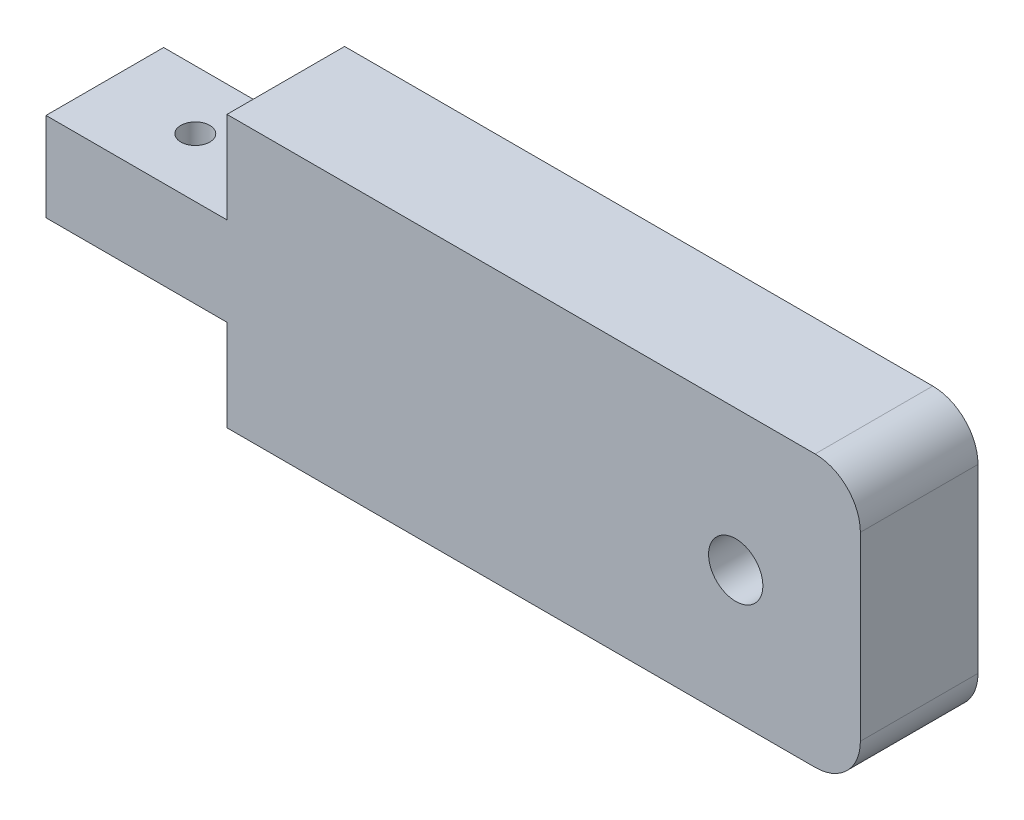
ISO-10303-21;
HEADER;
FILE_DESCRIPTION(('STEP AP214'),'2;1');
FILE_NAME('part.step','',(''),(''),'','','');
FILE_SCHEMA(('AUTOMOTIVE_DESIGN { 1 0 10303 214 1 1 1 1 }'));
ENDSEC;
DATA;
#1=APPLICATION_CONTEXT('core data for automotive mechanical design processes');
#2=APPLICATION_PROTOCOL_DEFINITION('international standard','automotive_design',2000,#1);
#3=PRODUCT_CONTEXT('',#1,'mechanical');
#4=PRODUCT('Part','Part','',(#3));
#5=PRODUCT_RELATED_PRODUCT_CATEGORY('part','',(#4));
#6=PRODUCT_DEFINITION_FORMATION('','',#4);
#7=PRODUCT_DEFINITION_CONTEXT('part definition',#1,'design');
#8=PRODUCT_DEFINITION('design','',#6,#7);
#9=PRODUCT_DEFINITION_SHAPE('','',#8);
#10=(LENGTH_UNIT() NAMED_UNIT(*) SI_UNIT(.MILLI.,.METRE.));
#11=(NAMED_UNIT(*) PLANE_ANGLE_UNIT() SI_UNIT($,.RADIAN.));
#12=(NAMED_UNIT(*) SI_UNIT($,.STERADIAN.) SOLID_ANGLE_UNIT());
#13=UNCERTAINTY_MEASURE_WITH_UNIT(LENGTH_MEASURE(1.E-05),#10,'distance_accuracy_value','');
#14=(GEOMETRIC_REPRESENTATION_CONTEXT(3) GLOBAL_UNCERTAINTY_ASSIGNED_CONTEXT((#13)) GLOBAL_UNIT_ASSIGNED_CONTEXT((#10,
#11,#12)) REPRESENTATION_CONTEXT('',''));
#15=CARTESIAN_POINT('',(0.,0.,0.));
#16=DIRECTION('',(0.,0.,1.));
#17=DIRECTION('',(1.,0.,0.));
#18=AXIS2_PLACEMENT_3D('',#15,#16,#17);
#19=CARTESIAN_POINT('',(0.,0.,13.));
#20=DIRECTION('',(0.,1.,0.));
#21=DIRECTION('',(0.,0.,1.));
#22=AXIS2_PLACEMENT_3D('',#19,#20,#21);
#23=PLANE('',#22);
#24=DIRECTION('',(1.,0.,0.));
#25=VECTOR('',#24,1.);
#26=CARTESIAN_POINT('',(0.,0.,13.));
#27=LINE('',#26,#25);
#28=CARTESIAN_POINT('',(278.325,0.,13.));
#29=VERTEX_POINT('',#28);
#30=CARTESIAN_POINT('',(343.325,0.,13.));
#31=VERTEX_POINT('',#30);
#32=EDGE_CURVE('E170',#29,#31,#27,.T.);
#33=ORIENTED_EDGE('',*,*,#32,.F.);
#34=DIRECTION('',(0.,0.,1.));
#35=VECTOR('',#34,1.);
#36=CARTESIAN_POINT('',(278.325,0.,0.));
#37=LINE('',#36,#35);
#38=CARTESIAN_POINT('',(278.325,0.,0.));
#39=VERTEX_POINT('',#38);
#40=EDGE_CURVE('E150',#39,#29,#37,.T.);
#41=ORIENTED_EDGE('',*,*,#40,.F.);
#42=DIRECTION('',(1.,0.,0.));
#43=VECTOR('',#42,1.);
#44=CARTESIAN_POINT('',(0.,0.,0.));
#45=LINE('',#44,#43);
#46=CARTESIAN_POINT('',(343.325,0.,0.));
#47=VERTEX_POINT('',#46);
#48=EDGE_CURVE('E161',#39,#47,#45,.T.);
#49=ORIENTED_EDGE('',*,*,#48,.T.);
#50=DIRECTION('',(0.,0.,-1.));
#51=VECTOR('',#50,1.);
#52=CARTESIAN_POINT('',(343.325,0.,13.));
#53=LINE('',#52,#51);
#54=EDGE_CURVE('E174',#47,#31,#53,.F.);
#55=ORIENTED_EDGE('',*,*,#54,.T.);
#56=EDGE_LOOP('',(#33,#41,#49,#55));
#57=FACE_BOUND('',#56,.T.);
#58=ADVANCED_FACE('F43',(#57),#23,.F.);
#59=CARTESIAN_POINT('',(0.,0.,13.));
#60=DIRECTION('',(0.,0.,1.));
#61=DIRECTION('',(1.,0.,0.));
#62=AXIS2_PLACEMENT_3D('',#59,#60,#61);
#63=PLANE('',#62);
#64=DIRECTION('',(-1.,0.,0.));
#65=VECTOR('',#64,1.);
#66=CARTESIAN_POINT('',(0.,10.1,13.));
#67=LINE('',#66,#65);
#68=CARTESIAN_POINT('',(278.325,10.1,13.));
#69=VERTEX_POINT('',#68);
#70=CARTESIAN_POINT('',(258.325,10.1,13.));
#71=VERTEX_POINT('',#70);
#72=EDGE_CURVE('E125',#69,#71,#67,.T.);
#73=ORIENTED_EDGE('',*,*,#72,.F.);
#74=DIRECTION('',(0.,1.,0.));
#75=VECTOR('',#74,1.);
#76=CARTESIAN_POINT('',(278.325,30.,13.));
#77=LINE('',#76,#75);
#78=EDGE_CURVE('E154',#29,#69,#77,.T.);
#79=ORIENTED_EDGE('',*,*,#78,.F.);
#80=ORIENTED_EDGE('',*,*,#32,.T.);
#81=CARTESIAN_POINT('',(343.325,5.,13.));
#82=DIRECTION('',(0.,0.,1.));
#83=DIRECTION('',(1.,0.,0.));
#84=AXIS2_PLACEMENT_3D('',#81,#82,#83);
#85=CIRCLE('',#84,5.);
#86=CARTESIAN_POINT('',(348.325,5.,13.));
#87=VERTEX_POINT('',#86);
#88=EDGE_CURVE('E167',#31,#87,#85,.T.);
#89=ORIENTED_EDGE('',*,*,#88,.T.);
#90=DIRECTION('',(0.,-1.,0.));
#91=VECTOR('',#90,1.);
#92=CARTESIAN_POINT('',(348.325,30.,13.));
#93=LINE('',#92,#91);
#94=CARTESIAN_POINT('',(348.325,25.,13.));
#95=VERTEX_POINT('',#94);
#96=EDGE_CURVE('E186',#95,#87,#93,.T.);
#97=ORIENTED_EDGE('',*,*,#96,.F.);
#98=CARTESIAN_POINT('',(343.325,25.,13.));
#99=DIRECTION('',(0.,0.,1.));
#100=DIRECTION('',(1.,0.,0.));
#101=AXIS2_PLACEMENT_3D('',#98,#99,#100);
#102=CIRCLE('',#101,5.);
#103=CARTESIAN_POINT('',(343.325,30.,13.));
#104=VERTEX_POINT('',#103);
#105=EDGE_CURVE('E169',#95,#104,#102,.T.);
#106=ORIENTED_EDGE('',*,*,#105,.T.);
#107=DIRECTION('',(1.,0.,0.));
#108=VECTOR('',#107,1.);
#109=CARTESIAN_POINT('',(0.,30.,13.));
#110=LINE('',#109,#108);
#111=CARTESIAN_POINT('',(278.325,30.,13.));
#112=VERTEX_POINT('',#111);
#113=EDGE_CURVE('E166',#112,#104,#110,.T.);
#114=ORIENTED_EDGE('',*,*,#113,.F.);
#115=CARTESIAN_POINT('',(278.325,19.9,13.));
#116=VERTEX_POINT('',#115);
#117=EDGE_CURVE('E153',#116,#112,#77,.T.);
#118=ORIENTED_EDGE('',*,*,#117,.F.);
#119=DIRECTION('',(1.,0.,0.));
#120=VECTOR('',#119,1.);
#121=CARTESIAN_POINT('',(0.,19.9,13.));
#122=LINE('',#121,#120);
#123=CARTESIAN_POINT('',(258.325,19.9,13.));
#124=VERTEX_POINT('',#123);
#125=EDGE_CURVE('E124',#124,#116,#122,.T.);
#126=ORIENTED_EDGE('',*,*,#125,.F.);
#127=DIRECTION('',(0.,1.,0.));
#128=VECTOR('',#127,1.);
#129=CARTESIAN_POINT('',(258.325,19.9,13.));
#130=LINE('',#129,#128);
#131=EDGE_CURVE('E132',#71,#124,#130,.T.);
#132=ORIENTED_EDGE('',*,*,#131,.F.);
#133=EDGE_LOOP('',(#73,#79,#80,#89,#97,#106,#114,#118,#126,#132));
#134=FACE_BOUND('',#133,.T.);
#135=CARTESIAN_POINT('',(334.55,14.5,13.));
#136=DIRECTION('',(0.,0.,1.));
#137=DIRECTION('',(1.,0.,0.));
#138=AXIS2_PLACEMENT_3D('',#135,#136,#137);
#139=CIRCLE('',#138,2.99999999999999);
#140=CARTESIAN_POINT('',(337.55,14.5,13.));
#141=VERTEX_POINT('',#140);
#142=EDGE_CURVE('E203',#141,#141,#139,.T.);
#143=ORIENTED_EDGE('',*,*,#142,.F.);
#144=EDGE_LOOP('',(#143));
#145=FACE_BOUND('',#144,.T.);
#146=ADVANCED_FACE('F232',(#134,#145),#63,.T.);
#147=CARTESIAN_POINT('',(0.,0.,0.));
#148=DIRECTION('',(0.,0.,1.));
#149=DIRECTION('',(1.,0.,0.));
#150=AXIS2_PLACEMENT_3D('',#147,#148,#149);
#151=PLANE('',#150);
#152=DIRECTION('',(-1.,0.,0.));
#153=VECTOR('',#152,1.);
#154=CARTESIAN_POINT('',(0.,19.9,0.));
#155=LINE('',#154,#153);
#156=CARTESIAN_POINT('',(278.325,19.9,0.));
#157=VERTEX_POINT('',#156);
#158=CARTESIAN_POINT('',(258.325,19.9,0.));
#159=VERTEX_POINT('',#158);
#160=EDGE_CURVE('E51',#157,#159,#155,.T.);
#161=ORIENTED_EDGE('',*,*,#160,.F.);
#162=DIRECTION('',(0.,-1.,0.));
#163=VECTOR('',#162,1.);
#164=CARTESIAN_POINT('',(278.325,30.,0.));
#165=LINE('',#164,#163);
#166=CARTESIAN_POINT('',(278.325,30.,0.));
#167=VERTEX_POINT('',#166);
#168=EDGE_CURVE('E147',#167,#157,#165,.T.);
#169=ORIENTED_EDGE('',*,*,#168,.F.);
#170=DIRECTION('',(1.,0.,0.));
#171=VECTOR('',#170,1.);
#172=CARTESIAN_POINT('',(0.,30.,0.));
#173=LINE('',#172,#171);
#174=CARTESIAN_POINT('',(343.325,30.,0.));
#175=VERTEX_POINT('',#174);
#176=EDGE_CURVE('E173',#167,#175,#173,.T.);
#177=ORIENTED_EDGE('',*,*,#176,.T.);
#178=CARTESIAN_POINT('',(343.325,25.,0.));
#179=DIRECTION('',(0.,0.,1.));
#180=DIRECTION('',(1.,0.,0.));
#181=AXIS2_PLACEMENT_3D('',#178,#179,#180);
#182=CIRCLE('',#181,5.);
#183=CARTESIAN_POINT('',(348.325,25.,0.));
#184=VERTEX_POINT('',#183);
#185=EDGE_CURVE('E180',#175,#184,#182,.F.);
#186=ORIENTED_EDGE('',*,*,#185,.T.);
#187=DIRECTION('',(0.,1.,0.));
#188=VECTOR('',#187,1.);
#189=CARTESIAN_POINT('',(348.325,30.,0.));
#190=LINE('',#189,#188);
#191=CARTESIAN_POINT('',(348.325,5.,0.));
#192=VERTEX_POINT('',#191);
#193=EDGE_CURVE('E185',#192,#184,#190,.T.);
#194=ORIENTED_EDGE('',*,*,#193,.F.);
#195=CARTESIAN_POINT('',(343.325,5.,0.));
#196=DIRECTION('',(0.,0.,1.));
#197=DIRECTION('',(1.,0.,0.));
#198=AXIS2_PLACEMENT_3D('',#195,#196,#197);
#199=CIRCLE('',#198,5.);
#200=EDGE_CURVE('E177',#192,#47,#199,.F.);
#201=ORIENTED_EDGE('',*,*,#200,.T.);
#202=ORIENTED_EDGE('',*,*,#48,.F.);
#203=CARTESIAN_POINT('',(278.325,10.1,0.));
#204=VERTEX_POINT('',#203);
#205=EDGE_CURVE('E123',#204,#39,#165,.T.);
#206=ORIENTED_EDGE('',*,*,#205,.F.);
#207=DIRECTION('',(1.,0.,0.));
#208=VECTOR('',#207,1.);
#209=CARTESIAN_POINT('',(0.,10.1,0.));
#210=LINE('',#209,#208);
#211=CARTESIAN_POINT('',(258.325,10.1,0.));
#212=VERTEX_POINT('',#211);
#213=EDGE_CURVE('E58',#212,#204,#210,.T.);
#214=ORIENTED_EDGE('',*,*,#213,.F.);
#215=DIRECTION('',(0.,-1.,0.));
#216=VECTOR('',#215,1.);
#217=CARTESIAN_POINT('',(258.325,19.9,0.));
#218=LINE('',#217,#216);
#219=EDGE_CURVE('E121',#159,#212,#218,.T.);
#220=ORIENTED_EDGE('',*,*,#219,.F.);
#221=EDGE_LOOP('',(#161,#169,#177,#186,#194,#201,#202,#206,#214,#220));
#222=FACE_BOUND('',#221,.T.);
#223=CARTESIAN_POINT('',(334.55,14.5,0.));
#224=DIRECTION('',(0.,0.,-1.));
#225=DIRECTION('',(-1.,0.,0.));
#226=AXIS2_PLACEMENT_3D('',#223,#224,#225);
#227=CIRCLE('',#226,13.25);
#228=CARTESIAN_POINT('',(321.3,14.5,0.));
#229=VERTEX_POINT('',#228);
#230=EDGE_CURVE('E190',#229,#229,#227,.T.);
#231=ORIENTED_EDGE('',*,*,#230,.F.);
#232=EDGE_LOOP('',(#231));
#233=FACE_BOUND('',#232,.T.);
#234=ADVANCED_FACE('F118',(#222,#233),#151,.F.);
#235=CARTESIAN_POINT('',(0.,30.,13.));
#236=DIRECTION('',(0.,1.,0.));
#237=DIRECTION('',(-1.,0.,0.));
#238=AXIS2_PLACEMENT_3D('',#235,#236,#237);
#239=PLANE('',#238);
#240=ORIENTED_EDGE('',*,*,#176,.F.);
#241=DIRECTION('',(0.,0.,-1.));
#242=VECTOR('',#241,1.);
#243=CARTESIAN_POINT('',(278.325,30.,0.));
#244=LINE('',#243,#242);
#245=EDGE_CURVE('E157',#112,#167,#244,.T.);
#246=ORIENTED_EDGE('',*,*,#245,.F.);
#247=ORIENTED_EDGE('',*,*,#113,.T.);
#248=DIRECTION('',(0.,0.,1.));
#249=VECTOR('',#248,1.);
#250=CARTESIAN_POINT('',(343.325,30.,13.));
#251=LINE('',#250,#249);
#252=EDGE_CURVE('E162',#104,#175,#251,.F.);
#253=ORIENTED_EDGE('',*,*,#252,.T.);
#254=EDGE_LOOP('',(#240,#246,#247,#253));
#255=FACE_BOUND('',#254,.T.);
#256=ADVANCED_FACE('F220',(#255),#239,.T.);
#257=CARTESIAN_POINT('',(334.55,14.5,7.2));
#258=DIRECTION('',(0.,0.,1.));
#259=DIRECTION('',(1.,0.,0.));
#260=AXIS2_PLACEMENT_3D('',#257,#258,#259);
#261=PLANE('',#260);
#262=CARTESIAN_POINT('',(334.55,14.5,7.2));
#263=DIRECTION('',(0.,0.,-1.));
#264=DIRECTION('',(-1.,0.,0.));
#265=AXIS2_PLACEMENT_3D('',#262,#263,#264);
#266=CIRCLE('',#265,2.99999999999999);
#267=CARTESIAN_POINT('',(331.55,14.5,7.2));
#268=VERTEX_POINT('',#267);
#269=EDGE_CURVE('E206',#268,#268,#266,.T.);
#270=ORIENTED_EDGE('',*,*,#269,.F.);
#271=EDGE_LOOP('',(#270));
#272=FACE_BOUND('',#271,.T.);
#273=CARTESIAN_POINT('',(334.55,14.5,7.2));
#274=DIRECTION('',(0.,0.,1.));
#275=DIRECTION('',(1.,0.,0.));
#276=AXIS2_PLACEMENT_3D('',#273,#274,#275);
#277=CIRCLE('',#276,13.25);
#278=CARTESIAN_POINT('',(321.3,14.5,7.19999999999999));
#279=VERTEX_POINT('',#278);
#280=EDGE_CURVE('E165',#279,#279,#277,.F.);
#281=ORIENTED_EDGE('',*,*,#280,.T.);
#282=EDGE_LOOP('',(#281));
#283=FACE_BOUND('',#282,.T.);
#284=ADVANCED_FACE('F255',(#272,#283),#261,.F.);
#285=CARTESIAN_POINT('',(348.325,0.,0.));
#286=DIRECTION('',(1.,0.,0.));
#287=DIRECTION('',(0.,0.,-1.));
#288=AXIS2_PLACEMENT_3D('',#285,#286,#287);
#289=PLANE('',#288);
#290=ORIENTED_EDGE('',*,*,#96,.T.);
#291=DIRECTION('',(0.,0.,-1.));
#292=VECTOR('',#291,1.);
#293=CARTESIAN_POINT('',(348.325,5.,0.));
#294=LINE('',#293,#292);
#295=EDGE_CURVE('E182',#87,#192,#294,.T.);
#296=ORIENTED_EDGE('',*,*,#295,.T.);
#297=ORIENTED_EDGE('',*,*,#193,.T.);
#298=DIRECTION('',(0.,0.,1.));
#299=VECTOR('',#298,1.);
#300=CARTESIAN_POINT('',(348.325,25.,0.));
#301=LINE('',#300,#299);
#302=EDGE_CURVE('E187',#184,#95,#301,.T.);
#303=ORIENTED_EDGE('',*,*,#302,.T.);
#304=EDGE_LOOP('',(#290,#296,#297,#303));
#305=FACE_BOUND('',#304,.T.);
#306=ADVANCED_FACE('F227',(#305),#289,.T.);
#307=CARTESIAN_POINT('',(343.325,5.,0.));
#308=DIRECTION('',(0.,0.,1.));
#309=DIRECTION('',(1.,0.,0.));
#310=AXIS2_PLACEMENT_3D('',#307,#308,#309);
#311=CYLINDRICAL_SURFACE('',#310,5.);
#312=ORIENTED_EDGE('',*,*,#88,.F.);
#313=ORIENTED_EDGE('',*,*,#54,.F.);
#314=ORIENTED_EDGE('',*,*,#200,.F.);
#315=ORIENTED_EDGE('',*,*,#295,.F.);
#316=EDGE_LOOP('',(#312,#313,#314,#315));
#317=FACE_BOUND('',#316,.T.);
#318=ADVANCED_FACE('F236',(#317),#311,.T.);
#319=CARTESIAN_POINT('',(343.325,25.,0.));
#320=DIRECTION('',(0.,0.,1.));
#321=DIRECTION('',(1.,0.,0.));
#322=AXIS2_PLACEMENT_3D('',#319,#320,#321);
#323=CYLINDRICAL_SURFACE('',#322,5.);
#324=ORIENTED_EDGE('',*,*,#185,.F.);
#325=ORIENTED_EDGE('',*,*,#252,.F.);
#326=ORIENTED_EDGE('',*,*,#105,.F.);
#327=ORIENTED_EDGE('',*,*,#302,.F.);
#328=EDGE_LOOP('',(#324,#325,#326,#327));
#329=FACE_BOUND('',#328,.T.);
#330=ADVANCED_FACE('F230',(#329),#323,.T.);
#331=CARTESIAN_POINT('',(334.55,14.5,44.676659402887));
#332=DIRECTION('',(0.,0.,-1.));
#333=DIRECTION('',(-1.,0.,0.));
#334=AXIS2_PLACEMENT_3D('',#331,#332,#333);
#335=CYLINDRICAL_SURFACE('',#334,13.25);
#336=CARTESIAN_POINT('',(321.3,14.5,0.));
#337=CARTESIAN_POINT('',(321.3,14.5,0.075000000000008));
#338=CARTESIAN_POINT('',(321.3,14.5,0.150000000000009));
#339=CARTESIAN_POINT('',(321.3,14.5,0.300000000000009));
#340=CARTESIAN_POINT('',(321.3,14.5,0.375000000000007));
#341=CARTESIAN_POINT('',(321.3,14.5,0.525000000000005));
#342=CARTESIAN_POINT('',(321.3,14.5,0.600000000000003));
#343=CARTESIAN_POINT('',(321.3,14.5,0.750000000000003));
#344=CARTESIAN_POINT('',(321.3,14.5,0.825000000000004));
#345=CARTESIAN_POINT('',(321.3,14.5,0.975000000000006));
#346=CARTESIAN_POINT('',(321.3,14.5,1.05000000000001));
#347=CARTESIAN_POINT('',(321.3,14.5,1.20000000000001));
#348=CARTESIAN_POINT('',(321.3,14.5,1.27500000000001));
#349=CARTESIAN_POINT('',(321.3,14.5,1.425));
#350=CARTESIAN_POINT('',(321.3,14.5,1.5));
#351=CARTESIAN_POINT('',(321.3,14.5,1.65));
#352=CARTESIAN_POINT('',(321.3,14.5,1.725));
#353=CARTESIAN_POINT('',(321.3,14.5,1.875));
#354=CARTESIAN_POINT('',(321.3,14.5,1.95));
#355=CARTESIAN_POINT('',(321.3,14.5,2.1));
#356=CARTESIAN_POINT('',(321.3,14.5,2.175));
#357=CARTESIAN_POINT('',(321.3,14.5,2.325));
#358=CARTESIAN_POINT('',(321.3,14.5,2.4));
#359=CARTESIAN_POINT('',(321.3,14.5,2.55));
#360=CARTESIAN_POINT('',(321.3,14.5,2.625));
#361=CARTESIAN_POINT('',(321.3,14.5,2.775));
#362=CARTESIAN_POINT('',(321.3,14.5,2.85));
#363=CARTESIAN_POINT('',(321.3,14.5,3.));
#364=CARTESIAN_POINT('',(321.3,14.5,3.075));
#365=CARTESIAN_POINT('',(321.3,14.5,3.225));
#366=CARTESIAN_POINT('',(321.3,14.5,3.3));
#367=CARTESIAN_POINT('',(321.3,14.5,3.45));
#368=CARTESIAN_POINT('',(321.3,14.5,3.525));
#369=CARTESIAN_POINT('',(321.3,14.5,3.675));
#370=CARTESIAN_POINT('',(321.3,14.5,3.75));
#371=CARTESIAN_POINT('',(321.3,14.5,3.9));
#372=CARTESIAN_POINT('',(321.3,14.5,3.975));
#373=CARTESIAN_POINT('',(321.3,14.5,4.125));
#374=CARTESIAN_POINT('',(321.3,14.5,4.2));
#375=CARTESIAN_POINT('',(321.3,14.5,4.35));
#376=CARTESIAN_POINT('',(321.3,14.5,4.425));
#377=CARTESIAN_POINT('',(321.3,14.5,4.575));
#378=CARTESIAN_POINT('',(321.3,14.5,4.65));
#379=CARTESIAN_POINT('',(321.3,14.5,4.8));
#380=CARTESIAN_POINT('',(321.3,14.5,4.875));
#381=CARTESIAN_POINT('',(321.3,14.5,5.025));
#382=CARTESIAN_POINT('',(321.3,14.5,5.09999999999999));
#383=CARTESIAN_POINT('',(321.3,14.5,5.24999999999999));
#384=CARTESIAN_POINT('',(321.3,14.5,5.32499999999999));
#385=CARTESIAN_POINT('',(321.3,14.5,5.475));
#386=CARTESIAN_POINT('',(321.3,14.5,5.55));
#387=CARTESIAN_POINT('',(321.3,14.5,5.7));
#388=CARTESIAN_POINT('',(321.3,14.5,5.775));
#389=CARTESIAN_POINT('',(321.3,14.5,5.92499999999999));
#390=CARTESIAN_POINT('',(321.3,14.5,5.99999999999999));
#391=CARTESIAN_POINT('',(321.3,14.5,6.14999999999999));
#392=CARTESIAN_POINT('',(321.3,14.5,6.22499999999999));
#393=CARTESIAN_POINT('',(321.3,14.5,6.37499999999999));
#394=CARTESIAN_POINT('',(321.3,14.5,6.44999999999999));
#395=CARTESIAN_POINT('',(321.3,14.5,6.59999999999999));
#396=CARTESIAN_POINT('',(321.3,14.5,6.67499999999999));
#397=CARTESIAN_POINT('',(321.3,14.5,6.82499999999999));
#398=CARTESIAN_POINT('',(321.3,14.5,6.89999999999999));
#399=CARTESIAN_POINT('',(321.3,14.5,7.04999999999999));
#400=CARTESIAN_POINT('',(321.3,14.5,7.12499999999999));
#401=CARTESIAN_POINT('',(321.3,14.5,7.19999999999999));
#402=B_SPLINE_CURVE_WITH_KNOTS('',3,(#336,#337,#338,#339,#340,#341,#342,#343,#344,#345,#346,
#347,#348,#349,#350,#351,#352,#353,#354,#355,#356,#357,#358,#359,#360,#361,#362,#363,#364,#365,
#366,#367,#368,#369,#370,#371,#372,#373,#374,#375,#376,#377,#378,#379,#380,#381,#382,#383,#384,
#385,#386,#387,#388,#389,#390,#391,#392,#393,#394,#395,#396,#397,#398,#399,#400,#401),
.UNSPECIFIED.,.F.,.F.,(4,2,2,2,2,2,2,2,2,2,2,2,2,2,2,2,2,2,2,2,2,2,2,2,2,2,2,2,2,2,2,2,4),(0.,
0.225000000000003,0.449999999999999,0.674999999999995,0.899999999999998,1.125,1.35,
1.57499999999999,1.8,2.025,2.25,2.47499999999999,2.69999999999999,2.925,3.14999999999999,
3.37499999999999,3.59999999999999,3.82499999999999,4.04999999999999,4.27499999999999,
4.49999999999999,4.72499999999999,4.94999999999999,5.17499999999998,5.39999999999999,
5.62499999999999,5.84999999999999,6.07499999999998,6.29999999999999,6.52499999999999,
6.74999999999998,6.97499999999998,7.19999999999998),.UNSPECIFIED.);
#403=EDGE_CURVE('BSEAM263',#229,#279,#402,.T.);
#404=ORIENTED_EDGE('',*,*,#230,.T.);
#405=ORIENTED_EDGE('',*,*,#280,.F.);
#406=ORIENTED_EDGE('',*,*,#403,.T.);
#407=ORIENTED_EDGE('',*,*,#403,.F.);
#408=EDGE_LOOP('',(#404,#406,#405,#407));
#409=FACE_BOUND('',#408,.T.);
#410=ADVANCED_FACE('F263',(#409),#335,.F.);
#411=CARTESIAN_POINT('',(334.55,14.5,73.));
#412=DIRECTION('',(0.,0.,-1.));
#413=DIRECTION('',(-1.,0.,0.));
#414=AXIS2_PLACEMENT_3D('',#411,#412,#413);
#415=CYLINDRICAL_SURFACE('',#414,2.99999999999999);
#416=ORIENTED_EDGE('',*,*,#142,.T.);
#417=EDGE_LOOP('',(#416));
#418=FACE_BOUND('',#417,.T.);
#419=ORIENTED_EDGE('',*,*,#269,.T.);
#420=EDGE_LOOP('',(#419));
#421=FACE_BOUND('',#420,.T.);
#422=ADVANCED_FACE('F266',(#418,#421),#415,.F.);
#423=CARTESIAN_POINT('',(0.,10.1,73.));
#424=DIRECTION('',(0.,1.,0.));
#425=DIRECTION('',(-1.,0.,0.));
#426=AXIS2_PLACEMENT_3D('',#423,#424,#425);
#427=PLANE('',#426);
#428=CARTESIAN_POINT('',(268.325,10.1,6.5));
#429=DIRECTION('',(0.,1.,0.));
#430=DIRECTION('',(-1.,0.,0.));
#431=AXIS2_PLACEMENT_3D('',#428,#429,#430);
#432=CIRCLE('',#431,1.59999999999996);
#433=CARTESIAN_POINT('',(266.725,10.1,6.5));
#434=VERTEX_POINT('',#433);
#435=EDGE_CURVE('E138',#434,#434,#432,.T.);
#436=ORIENTED_EDGE('',*,*,#435,.T.);
#437=EDGE_LOOP('',(#436));
#438=FACE_BOUND('',#437,.T.);
#439=ORIENTED_EDGE('',*,*,#213,.T.);
#440=DIRECTION('',(0.,0.,1.));
#441=VECTOR('',#440,1.);
#442=CARTESIAN_POINT('',(278.325,10.1,73.));
#443=LINE('',#442,#441);
#444=EDGE_CURVE('E62',#204,#69,#443,.T.);
#445=ORIENTED_EDGE('',*,*,#444,.T.);
#446=ORIENTED_EDGE('',*,*,#72,.T.);
#447=DIRECTION('',(0.,0.,1.));
#448=VECTOR('',#447,1.);
#449=CARTESIAN_POINT('',(258.325,10.1,0.));
#450=LINE('',#449,#448);
#451=EDGE_CURVE('E127',#212,#71,#450,.T.);
#452=ORIENTED_EDGE('',*,*,#451,.F.);
#453=EDGE_LOOP('',(#439,#445,#446,#452));
#454=FACE_BOUND('',#453,.T.);
#455=ADVANCED_FACE('F128',(#438,#454),#427,.F.);
#456=CARTESIAN_POINT('',(0.,19.9,73.));
#457=DIRECTION('',(0.,-1.,0.));
#458=DIRECTION('',(0.,0.,-1.));
#459=AXIS2_PLACEMENT_3D('',#456,#457,#458);
#460=PLANE('',#459);
#461=CARTESIAN_POINT('',(268.325,19.9,6.5));
#462=DIRECTION('',(0.,1.,0.));
#463=DIRECTION('',(0.,0.,1.));
#464=AXIS2_PLACEMENT_3D('',#461,#462,#463);
#465=CIRCLE('',#464,1.59999999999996);
#466=CARTESIAN_POINT('',(268.325,19.9,8.09999999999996));
#467=VERTEX_POINT('',#466);
#468=EDGE_CURVE('E141',#467,#467,#465,.T.);
#469=ORIENTED_EDGE('',*,*,#468,.F.);
#470=EDGE_LOOP('',(#469));
#471=FACE_BOUND('',#470,.T.);
#472=ORIENTED_EDGE('',*,*,#125,.T.);
#473=DIRECTION('',(0.,0.,-1.));
#474=VECTOR('',#473,1.);
#475=CARTESIAN_POINT('',(278.325,19.9,73.));
#476=LINE('',#475,#474);
#477=EDGE_CURVE('E11',#116,#157,#476,.T.);
#478=ORIENTED_EDGE('',*,*,#477,.T.);
#479=ORIENTED_EDGE('',*,*,#160,.T.);
#480=DIRECTION('',(0.,0.,-1.));
#481=VECTOR('',#480,1.);
#482=CARTESIAN_POINT('',(258.325,19.9,0.));
#483=LINE('',#482,#481);
#484=EDGE_CURVE('E137',#124,#159,#483,.T.);
#485=ORIENTED_EDGE('',*,*,#484,.F.);
#486=EDGE_LOOP('',(#472,#478,#479,#485));
#487=FACE_BOUND('',#486,.T.);
#488=ADVANCED_FACE('F45',(#471,#487),#460,.F.);
#489=CARTESIAN_POINT('',(278.325,0.,0.));
#490=DIRECTION('',(-1.,0.,0.));
#491=DIRECTION('',(0.,0.,1.));
#492=AXIS2_PLACEMENT_3D('',#489,#490,#491);
#493=PLANE('',#492);
#494=ORIENTED_EDGE('',*,*,#444,.F.);
#495=ORIENTED_EDGE('',*,*,#205,.T.);
#496=ORIENTED_EDGE('',*,*,#40,.T.);
#497=ORIENTED_EDGE('',*,*,#78,.T.);
#498=EDGE_LOOP('',(#494,#495,#496,#497));
#499=FACE_BOUND('',#498,.T.);
#500=ADVANCED_FACE('F241',(#499),#493,.T.);
#501=ORIENTED_EDGE('',*,*,#477,.F.);
#502=ORIENTED_EDGE('',*,*,#117,.T.);
#503=ORIENTED_EDGE('',*,*,#245,.T.);
#504=ORIENTED_EDGE('',*,*,#168,.T.);
#505=EDGE_LOOP('',(#501,#502,#503,#504));
#506=FACE_BOUND('',#505,.T.);
#507=ADVANCED_FACE('F215',(#506),#493,.T.);
#508=CARTESIAN_POINT('',(258.325,0.,0.));
#509=DIRECTION('',(-1.,0.,0.));
#510=DIRECTION('',(0.,0.,1.));
#511=AXIS2_PLACEMENT_3D('',#508,#509,#510);
#512=PLANE('',#511);
#513=ORIENTED_EDGE('',*,*,#219,.T.);
#514=ORIENTED_EDGE('',*,*,#451,.T.);
#515=ORIENTED_EDGE('',*,*,#131,.T.);
#516=ORIENTED_EDGE('',*,*,#484,.T.);
#517=EDGE_LOOP('',(#513,#514,#515,#516));
#518=FACE_BOUND('',#517,.T.);
#519=ADVANCED_FACE('F135',(#518),#512,.T.);
#520=CARTESIAN_POINT('',(268.325,0.,6.5));
#521=DIRECTION('',(0.,1.,0.));
#522=DIRECTION('',(0.,0.,1.));
#523=AXIS2_PLACEMENT_3D('',#520,#521,#522);
#524=CYLINDRICAL_SURFACE('',#523,1.59999999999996);
#525=ORIENTED_EDGE('',*,*,#468,.T.);
#526=EDGE_LOOP('',(#525));
#527=FACE_BOUND('',#526,.T.);
#528=ORIENTED_EDGE('',*,*,#435,.F.);
#529=EDGE_LOOP('',(#528));
#530=FACE_BOUND('',#529,.T.);
#531=ADVANCED_FACE('F278',(#527,#530),#524,.F.);
#532=CLOSED_SHELL('',(#58,#146,#234,#256,#284,#306,#318,#330,#410,#422,#455,#488,#500,#507,#519,#531));
#533=MANIFOLD_SOLID_BREP('B2',#532);
#534=ADVANCED_BREP_SHAPE_REPRESENTATION('',(#18,#533),#14);
#535=SHAPE_DEFINITION_REPRESENTATION(#9,#534);
ENDSEC;
END-ISO-10303-21;
